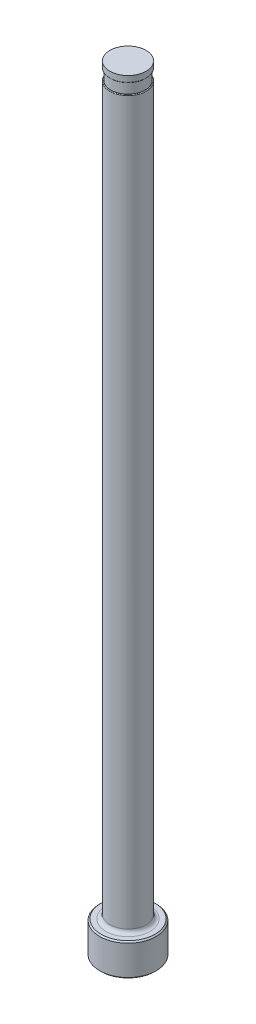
ISO-10303-21;
HEADER;
FILE_DESCRIPTION(('STEP AP214'),'2;1');
FILE_NAME('part.step','',(''),(''),'','','');
FILE_SCHEMA(('AUTOMOTIVE_DESIGN { 1 0 10303 214 1 1 1 1 }'));
ENDSEC;
DATA;
#1=APPLICATION_CONTEXT('core data for automotive mechanical design processes');
#2=APPLICATION_PROTOCOL_DEFINITION('international standard','automotive_design',2000,#1);
#3=PRODUCT_CONTEXT('',#1,'mechanical');
#4=PRODUCT('Part','Part','',(#3));
#5=PRODUCT_RELATED_PRODUCT_CATEGORY('part','',(#4));
#6=PRODUCT_DEFINITION_FORMATION('','',#4);
#7=PRODUCT_DEFINITION_CONTEXT('part definition',#1,'design');
#8=PRODUCT_DEFINITION('design','',#6,#7);
#9=PRODUCT_DEFINITION_SHAPE('','',#8);
#10=(LENGTH_UNIT() NAMED_UNIT(*) SI_UNIT(.MILLI.,.METRE.));
#11=(NAMED_UNIT(*) PLANE_ANGLE_UNIT() SI_UNIT($,.RADIAN.));
#12=(NAMED_UNIT(*) SI_UNIT($,.STERADIAN.) SOLID_ANGLE_UNIT());
#13=UNCERTAINTY_MEASURE_WITH_UNIT(LENGTH_MEASURE(1.E-05),#10,'distance_accuracy_value','');
#14=(GEOMETRIC_REPRESENTATION_CONTEXT(3) GLOBAL_UNCERTAINTY_ASSIGNED_CONTEXT((#13)) GLOBAL_UNIT_ASSIGNED_CONTEXT((#10,
#11,#12)) REPRESENTATION_CONTEXT('',''));
#15=CARTESIAN_POINT('',(0.,0.,0.));
#16=DIRECTION('',(0.,0.,1.));
#17=DIRECTION('',(1.,0.,0.));
#18=AXIS2_PLACEMENT_3D('',#15,#16,#17);
#19=CARTESIAN_POINT('',(-3.57123999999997,151.13,0.));
#20=DIRECTION('',(0.,1.,0.));
#21=DIRECTION('',(0.,0.,1.));
#22=AXIS2_PLACEMENT_3D('',#19,#20,#21);
#23=PLANE('',#22);
#24=CARTESIAN_POINT('',(0.,151.13,0.));
#25=DIRECTION('',(0.,1.,0.));
#26=DIRECTION('',(0.,0.,1.));
#27=AXIS2_PLACEMENT_3D('',#24,#25,#26);
#28=CIRCLE('',#27,3.43153999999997);
#29=CARTESIAN_POINT('',(0.,151.13,3.43153999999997));
#30=VERTEX_POINT('',#29);
#31=EDGE_CURVE('E11',#30,#30,#28,.F.);
#32=ORIENTED_EDGE('',*,*,#31,.T.);
#33=EDGE_LOOP('',(#32));
#34=FACE_BOUND('',#33,.T.);
#35=CARTESIAN_POINT('',(0.,151.13,0.));
#36=DIRECTION('',(0.,1.,0.));
#37=DIRECTION('',(0.,0.,1.));
#38=AXIS2_PLACEMENT_3D('',#35,#36,#37);
#39=CIRCLE('',#38,3.36803999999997);
#40=CARTESIAN_POINT('',(0.,151.13,3.36803999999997));
#41=VERTEX_POINT('',#40);
#42=EDGE_CURVE('E78',#41,#41,#39,.T.);
#43=ORIENTED_EDGE('',*,*,#42,.T.);
#44=EDGE_LOOP('',(#43));
#45=FACE_BOUND('',#44,.T.);
#46=ADVANCED_FACE('F36',(#34,#45),#23,.F.);
#47=CARTESIAN_POINT('',(0.,259.958771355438,0.));
#48=DIRECTION('',(0.,1.,0.));
#49=DIRECTION('',(0.,0.,1.));
#50=AXIS2_PLACEMENT_3D('',#47,#48,#49);
#51=CYLINDRICAL_SURFACE('',#50,3.57123999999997);
#52=DIRECTION('',(0.,1.,0.));
#53=VECTOR('',#52,1.);
#54=CARTESIAN_POINT('',(-3.36803999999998,259.958771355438,-1.18746018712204));
#55=LINE('',#54,#53);
#56=CARTESIAN_POINT('',(-3.36803999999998,148.971,-1.18746018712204));
#57=VERTEX_POINT('',#56);
#58=CARTESIAN_POINT('',(-3.36803999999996,86.614,-1.1874601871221));
#59=VERTEX_POINT('',#58);
#60=EDGE_CURVE('E73',#57,#59,#55,.F.);
#61=ORIENTED_EDGE('',*,*,#60,.F.);
#62=CARTESIAN_POINT('',(0.,148.971,0.));
#63=DIRECTION('',(0.,-1.,0.));
#64=DIRECTION('',(0.,0.,-1.));
#65=AXIS2_PLACEMENT_3D('',#62,#63,#64);
#66=CIRCLE('',#65,3.57123999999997);
#67=CARTESIAN_POINT('',(-3.36803999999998,148.971,1.18746018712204));
#68=VERTEX_POINT('',#67);
#69=EDGE_CURVE('E51',#57,#68,#66,.T.);
#70=ORIENTED_EDGE('',*,*,#69,.T.);
#71=DIRECTION('',(0.,1.,0.));
#72=VECTOR('',#71,1.);
#73=CARTESIAN_POINT('',(-3.36803999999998,259.958771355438,1.18746018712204));
#74=LINE('',#73,#72);
#75=CARTESIAN_POINT('',(-3.36803999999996,86.614,1.18746018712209));
#76=VERTEX_POINT('',#75);
#77=EDGE_CURVE('E84',#76,#68,#74,.T.);
#78=ORIENTED_EDGE('',*,*,#77,.F.);
#79=CARTESIAN_POINT('',(-3.36803999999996,86.614,-1.1874601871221));
#80=CARTESIAN_POINT('',(-3.3680377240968,86.5836283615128,-1.18745959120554));
#81=CARTESIAN_POINT('',(-3.36847634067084,86.55327189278,-1.18622334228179));
#82=CARTESIAN_POINT('',(-3.37021067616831,86.4927876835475,-1.18128966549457));
#83=CARTESIAN_POINT('',(-3.37150629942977,86.4626599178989,-1.1775925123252));
#84=CARTESIAN_POINT('',(-3.37663245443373,86.3730705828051,-1.16285138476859));
#85=CARTESIAN_POINT('',(-3.38170254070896,86.3142347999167,-1.14815759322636));
#86=CARTESIAN_POINT('',(-3.39461112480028,86.2000784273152,-1.10940606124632));
#87=CARTESIAN_POINT('',(-3.40245035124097,86.1447587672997,-1.08534585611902));
#88=CARTESIAN_POINT('',(-3.42005737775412,86.0391328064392,-1.02851526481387));
#89=CARTESIAN_POINT('',(-3.42982508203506,85.9888262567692,-0.995745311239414));
#90=CARTESIAN_POINT('',(-3.45028756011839,85.8943803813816,-0.922345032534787));
#91=CARTESIAN_POINT('',(-3.4609842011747,85.8502539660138,-0.881698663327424));
#92=CARTESIAN_POINT('',(-3.482209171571,85.7691926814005,-0.793737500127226));
#93=CARTESIAN_POINT('',(-3.49273745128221,85.7322598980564,-0.746420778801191));
#94=CARTESIAN_POINT('',(-3.51307583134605,85.6646585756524,-0.644120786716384));
#95=CARTESIAN_POINT('',(-3.52283072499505,85.6343557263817,-0.588885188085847));
#96=CARTESIAN_POINT('',(-3.54010786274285,85.5826078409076,-0.474091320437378));
#97=CARTESIAN_POINT('',(-3.54762954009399,85.5611650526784,-0.414531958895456));
#98=CARTESIAN_POINT('',(-3.56012114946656,85.5262555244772,-0.288969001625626));
#99=CARTESIAN_POINT('',(-3.56491124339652,85.5133434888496,-0.222793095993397));
#100=CARTESIAN_POINT('',(-3.57075657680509,85.497655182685,-0.0890807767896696));
#101=CARTESIAN_POINT('',(-3.57181063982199,85.494882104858,-0.0215439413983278));
#102=CARTESIAN_POINT('',(-3.57004535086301,85.4995778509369,0.115996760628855));
#103=CARTESIAN_POINT('',(-3.56706025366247,85.507484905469,0.185984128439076));
#104=CARTESIAN_POINT('',(-3.55722219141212,85.5343152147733,0.323545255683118));
#105=CARTESIAN_POINT('',(-3.55036911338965,85.5532387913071,0.391118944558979));
#106=CARTESIAN_POINT('',(-3.53356592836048,85.6018994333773,0.521506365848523));
#107=CARTESIAN_POINT('',(-3.52363012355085,85.6315866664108,0.584340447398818));
#108=CARTESIAN_POINT('',(-3.50178692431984,85.701455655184,0.703501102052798));
#109=CARTESIAN_POINT('',(-3.4898802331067,85.7416336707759,0.759829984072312));
#110=CARTESIAN_POINT('',(-3.46618365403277,85.8294388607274,0.861343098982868));
#111=CARTESIAN_POINT('',(-3.45441819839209,85.8765877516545,0.906946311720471));
#112=CARTESIAN_POINT('',(-3.4318469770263,85.9785334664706,0.988936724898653));
#113=CARTESIAN_POINT('',(-3.42104103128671,86.0333288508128,1.02532565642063));
#114=CARTESIAN_POINT('',(-3.40231953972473,86.1454535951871,1.08578170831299));
#115=CARTESIAN_POINT('',(-3.3942694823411,86.2024337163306,1.11045708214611));
#116=CARTESIAN_POINT('',(-3.38112795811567,86.3200270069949,1.14985485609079));
#117=CARTESIAN_POINT('',(-3.37603276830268,86.3806354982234,1.16458978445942));
#118=CARTESIAN_POINT('',(-3.37115526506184,86.4705050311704,1.17859463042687));
#119=CARTESIAN_POINT('',(-3.36998926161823,86.4991157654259,1.18192009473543));
#120=CARTESIAN_POINT('',(-3.36843159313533,86.556479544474,1.18635035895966));
#121=CARTESIAN_POINT('',(-3.36803858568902,86.5852322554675,1.18745900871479));
#122=CARTESIAN_POINT('',(-3.36803999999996,86.614,1.1874601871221));
#123=B_SPLINE_CURVE_WITH_KNOTS('',3,(#79,#80,#81,#82,#83,#84,#85,#86,#87,#88,#89,#90,#91,#92,
#93,#94,#95,#96,#97,#98,#99,#100,#101,#102,#103,#104,#105,#106,#107,#108,#109,#110,#111,#112,
#113,#114,#115,#116,#117,#118,#119,#120,#121,#122),.UNSPECIFIED.,.F.,.F.,(4,2,2,2,2,2,2,2,2,2,2,
2,2,2,2,2,2,2,2,2,2,4),(0.,0.0910565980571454,0.182103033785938,0.363698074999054,
0.545340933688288,0.726974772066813,0.908982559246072,1.09104304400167,1.28146671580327,
1.47193867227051,1.67381993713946,1.87576476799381,2.08625256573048,2.29674651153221,
2.50627812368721,2.71573513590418,2.91462117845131,3.1134698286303,3.30038893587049,
3.48707202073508,3.57347157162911,3.65972094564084),.UNSPECIFIED.);
#124=EDGE_CURVE('E81',#59,#76,#123,.T.);
#125=ORIENTED_EDGE('',*,*,#124,.F.);
#126=EDGE_LOOP('',(#61,#70,#78,#125));
#127=FACE_BOUND('',#126,.T.);
#128=CARTESIAN_POINT('',(0.,7.11200000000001,0.));
#129=DIRECTION('',(0.,1.,0.));
#130=DIRECTION('',(0.,0.,1.));
#131=AXIS2_PLACEMENT_3D('',#128,#129,#130);
#132=CIRCLE('',#131,3.57123999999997);
#133=CARTESIAN_POINT('',(0.,7.11200000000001,3.57123999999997));
#134=VERTEX_POINT('',#133);
#135=EDGE_CURVE('E116',#134,#134,#132,.T.);
#136=ORIENTED_EDGE('',*,*,#135,.T.);
#137=EDGE_LOOP('',(#136));
#138=FACE_BOUND('',#137,.T.);
#139=ADVANCED_FACE('F82',(#127,#138),#51,.T.);
#140=CARTESIAN_POINT('',(0.,0.,0.));
#141=DIRECTION('',(0.,-1.,0.));
#142=DIRECTION('',(0.,0.,-1.));
#143=AXIS2_PLACEMENT_3D('',#140,#141,#142);
#144=PLANE('',#143);
#145=CARTESIAN_POINT('',(0.,0.,0.));
#146=DIRECTION('',(0.,-1.,0.));
#147=DIRECTION('',(0.,0.,-1.));
#148=AXIS2_PLACEMENT_3D('',#145,#146,#147);
#149=CIRCLE('',#148,5.29589999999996);
#150=CARTESIAN_POINT('',(0.,0.,-5.29589999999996));
#151=VERTEX_POINT('',#150);
#152=EDGE_CURVE('E113',#151,#151,#149,.T.);
#153=ORIENTED_EDGE('',*,*,#152,.T.);
#154=EDGE_LOOP('',(#153));
#155=FACE_BOUND('',#154,.T.);
#156=ADVANCED_FACE('F192',(#155),#144,.T.);
#157=CARTESIAN_POINT('',(0.,259.958771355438,0.));
#158=DIRECTION('',(0.,1.,0.));
#159=DIRECTION('',(0.,0.,1.));
#160=AXIS2_PLACEMENT_3D('',#157,#158,#159);
#161=CYLINDRICAL_SURFACE('',#160,5.54989999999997);
#162=CARTESIAN_POINT('',(0.,6.09599999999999,0.));
#163=DIRECTION('',(0.,1.,0.));
#164=DIRECTION('',(0.,0.,1.));
#165=AXIS2_PLACEMENT_3D('',#162,#163,#164);
#166=CIRCLE('',#165,5.54989999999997);
#167=CARTESIAN_POINT('',(0.,6.09599999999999,5.54989999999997));
#168=VERTEX_POINT('',#167);
#169=EDGE_CURVE('E110',#168,#168,#166,.F.);
#170=ORIENTED_EDGE('',*,*,#169,.T.);
#171=EDGE_LOOP('',(#170));
#172=FACE_BOUND('',#171,.T.);
#173=CARTESIAN_POINT('',(0.,0.253999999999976,0.));
#174=DIRECTION('',(0.,-1.,0.));
#175=DIRECTION('',(0.,0.,-1.));
#176=AXIS2_PLACEMENT_3D('',#173,#174,#175);
#177=CIRCLE('',#176,5.54989999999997);
#178=CARTESIAN_POINT('',(0.,0.253999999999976,-5.54989999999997));
#179=VERTEX_POINT('',#178);
#180=EDGE_CURVE('E107',#179,#179,#177,.F.);
#181=ORIENTED_EDGE('',*,*,#180,.T.);
#182=EDGE_LOOP('',(#181));
#183=FACE_BOUND('',#182,.T.);
#184=ADVANCED_FACE('F195',(#172,#183),#161,.T.);
#185=CARTESIAN_POINT('',(-5.54989999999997,6.35,0.));
#186=DIRECTION('',(0.,1.,0.));
#187=DIRECTION('',(0.,0.,1.));
#188=AXIS2_PLACEMENT_3D('',#185,#186,#187);
#189=PLANE('',#188);
#190=CARTESIAN_POINT('',(0.,6.35,0.));
#191=DIRECTION('',(0.,1.,0.));
#192=DIRECTION('',(0.,0.,1.));
#193=AXIS2_PLACEMENT_3D('',#190,#191,#192);
#194=CIRCLE('',#193,4.33323999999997);
#195=CARTESIAN_POINT('',(0.,6.35,4.33323999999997));
#196=VERTEX_POINT('',#195);
#197=EDGE_CURVE('E87',#196,#196,#194,.F.);
#198=ORIENTED_EDGE('',*,*,#197,.T.);
#199=EDGE_LOOP('',(#198));
#200=FACE_BOUND('',#199,.T.);
#201=CARTESIAN_POINT('',(0.,6.35,0.));
#202=DIRECTION('',(0.,1.,0.));
#203=DIRECTION('',(0.,0.,1.));
#204=AXIS2_PLACEMENT_3D('',#201,#202,#203);
#205=CIRCLE('',#204,5.29589999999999);
#206=CARTESIAN_POINT('',(0.,6.35,5.29589999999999));
#207=VERTEX_POINT('',#206);
#208=EDGE_CURVE('E104',#207,#207,#205,.T.);
#209=ORIENTED_EDGE('',*,*,#208,.T.);
#210=EDGE_LOOP('',(#209));
#211=FACE_BOUND('',#210,.T.);
#212=ADVANCED_FACE('F190',(#200,#211),#189,.T.);
#213=CARTESIAN_POINT('',(0.,6.35000000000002,0.));
#214=DIRECTION('',(0.,-1.,0.));
#215=DIRECTION('',(0.,0.,-1.));
#216=AXIS2_PLACEMENT_3D('',#213,#214,#215);
#217=CONICAL_SURFACE('',#216,5.29589999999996,0.785398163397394);
#218=ORIENTED_EDGE('',*,*,#169,.F.);
#219=EDGE_LOOP('',(#218));
#220=FACE_BOUND('',#219,.T.);
#221=ORIENTED_EDGE('',*,*,#208,.F.);
#222=EDGE_LOOP('',(#221));
#223=FACE_BOUND('',#222,.T.);
#224=ADVANCED_FACE('F186',(#220,#223),#217,.T.);
#225=CARTESIAN_POINT('',(0.,0.253999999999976,0.));
#226=DIRECTION('',(0.,1.,0.));
#227=DIRECTION('',(0.,0.,1.));
#228=AXIS2_PLACEMENT_3D('',#225,#226,#227);
#229=CONICAL_SURFACE('',#228,5.54989999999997,0.785398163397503);
#230=ORIENTED_EDGE('',*,*,#152,.F.);
#231=EDGE_LOOP('',(#230));
#232=FACE_BOUND('',#231,.T.);
#233=ORIENTED_EDGE('',*,*,#180,.F.);
#234=EDGE_LOOP('',(#233));
#235=FACE_BOUND('',#234,.T.);
#236=ADVANCED_FACE('F182',(#232,#235),#229,.T.);
#237=CARTESIAN_POINT('',(0.,7.11200000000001,0.));
#238=DIRECTION('',(0.,1.,0.));
#239=DIRECTION('',(0.,0.,1.));
#240=AXIS2_PLACEMENT_3D('',#237,#238,#239);
#241=TOROIDAL_SURFACE('',#240,4.33323999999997,0.762);
#242=ORIENTED_EDGE('',*,*,#197,.F.);
#243=EDGE_LOOP('',(#242));
#244=FACE_BOUND('',#243,.T.);
#245=ORIENTED_EDGE('',*,*,#135,.F.);
#246=EDGE_LOOP('',(#245));
#247=FACE_BOUND('',#246,.T.);
#248=ADVANCED_FACE('F147',(#244,#247),#241,.F.);
#249=CARTESIAN_POINT('',(-3.57123999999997,149.098,0.));
#250=DIRECTION('',(0.,-1.,0.));
#251=DIRECTION('',(0.,0.,-1.));
#252=AXIS2_PLACEMENT_3D('',#249,#250,#251);
#253=PLANE('',#252);
#254=DIRECTION('',(0.,0.,1.));
#255=VECTOR('',#254,1.);
#256=CARTESIAN_POINT('',(-3.36803999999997,149.098,0.));
#257=LINE('',#256,#255);
#258=CARTESIAN_POINT('',(-3.36803999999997,149.098,0.));
#259=VERTEX_POINT('',#258);
#260=CARTESIAN_POINT('',(-3.36803999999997,149.098,0.720482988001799));
#261=VERTEX_POINT('',#260);
#262=EDGE_CURVE('E90',#259,#261,#257,.T.);
#263=ORIENTED_EDGE('',*,*,#262,.T.);
#264=CARTESIAN_POINT('',(0.,149.098,0.));
#265=DIRECTION('',(0.,-1.,0.));
#266=DIRECTION('',(0.,0.,-1.));
#267=AXIS2_PLACEMENT_3D('',#264,#265,#266);
#268=CIRCLE('',#267,3.44423999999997);
#269=CARTESIAN_POINT('',(-3.36803999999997,149.098,-0.720482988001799));
#270=VERTEX_POINT('',#269);
#271=EDGE_CURVE('E86',#261,#270,#268,.F.);
#272=ORIENTED_EDGE('',*,*,#271,.T.);
#273=EDGE_CURVE('E79',#270,#259,#257,.T.);
#274=ORIENTED_EDGE('',*,*,#273,.T.);
#275=CARTESIAN_POINT('',(0.,149.098,0.));
#276=DIRECTION('',(0.,1.,0.));
#277=DIRECTION('',(0.,0.,1.));
#278=AXIS2_PLACEMENT_3D('',#275,#276,#277);
#279=CIRCLE('',#278,3.36803999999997);
#280=EDGE_CURVE('E101',#259,#259,#279,.T.);
#281=ORIENTED_EDGE('',*,*,#280,.F.);
#282=EDGE_LOOP('',(#263,#272,#274,#281));
#283=FACE_BOUND('',#282,.T.);
#284=ADVANCED_FACE('F144',(#283),#253,.F.);
#285=CARTESIAN_POINT('',(0.,153.448281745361,0.));
#286=DIRECTION('',(0.,1.,0.));
#287=DIRECTION('',(0.,0.,1.));
#288=AXIS2_PLACEMENT_3D('',#285,#286,#287);
#289=CYLINDRICAL_SURFACE('',#288,3.36803999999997);
#290=ORIENTED_EDGE('',*,*,#42,.F.);
#291=EDGE_LOOP('',(#290));
#292=FACE_BOUND('',#291,.T.);
#293=ORIENTED_EDGE('',*,*,#280,.T.);
#294=EDGE_LOOP('',(#293));
#295=FACE_BOUND('',#294,.T.);
#296=ADVANCED_FACE('F141',(#292,#295),#289,.T.);
#297=CARTESIAN_POINT('',(-3.36803999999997,150.114,-5.54989999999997));
#298=DIRECTION('',(1.,0.,0.));
#299=DIRECTION('',(0.,1.,0.));
#300=AXIS2_PLACEMENT_3D('',#297,#298,#299);
#301=PLANE('',#300);
#302=ORIENTED_EDGE('',*,*,#273,.F.);
#303=CARTESIAN_POINT('',(-3.36803999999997,149.098,-0.720482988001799));
#304=CARTESIAN_POINT('',(-3.36803999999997,149.097993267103,-0.741667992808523));
#305=CARTESIAN_POINT('',(-3.36803999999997,149.097767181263,-0.76285784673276));
#306=CARTESIAN_POINT('',(-3.36803999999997,149.09671621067,-0.80525692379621));
#307=CARTESIAN_POINT('',(-3.36803999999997,149.095890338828,-0.826466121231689));
#308=CARTESIAN_POINT('',(-3.36803999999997,149.093476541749,-0.86888093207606));
#309=CARTESIAN_POINT('',(-3.36803999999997,149.091887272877,-0.890086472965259));
#310=CARTESIAN_POINT('',(-3.36803999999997,149.087714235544,-0.932390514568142));
#311=CARTESIAN_POINT('',(-3.36803999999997,149.085131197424,-0.953489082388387));
#312=CARTESIAN_POINT('',(-3.36803999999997,149.079919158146,-0.987044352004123));
#313=CARTESIAN_POINT('',(-3.36803999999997,149.077725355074,-0.999568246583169));
#314=CARTESIAN_POINT('',(-3.36803999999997,149.072729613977,-1.02450849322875));
#315=CARTESIAN_POINT('',(-3.36803999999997,149.06992716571,-1.03692474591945));
#316=CARTESIAN_POINT('',(-3.36803999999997,149.06343040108,-1.06198397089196));
#317=CARTESIAN_POINT('',(-3.36803999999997,149.059708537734,-1.07461988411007));
#318=CARTESIAN_POINT('',(-3.36803999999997,149.051125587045,-1.09949809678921));
#319=CARTESIAN_POINT('',(-3.36803999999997,149.046266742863,-1.11174111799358));
#320=CARTESIAN_POINT('',(-3.36803999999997,149.037811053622,-1.12921604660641));
#321=CARTESIAN_POINT('',(-3.36803999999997,149.03488164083,-1.13476833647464));
#322=CARTESIAN_POINT('',(-3.36803999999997,149.028508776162,-1.14558508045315));
#323=CARTESIAN_POINT('',(-3.36803999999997,149.025064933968,-1.15084931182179));
#324=CARTESIAN_POINT('',(-3.36803999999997,149.018291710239,-1.15984658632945));
#325=CARTESIAN_POINT('',(-3.36803999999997,149.015085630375,-1.16367129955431));
#326=CARTESIAN_POINT('',(-3.36803999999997,149.008150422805,-1.17081956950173));
#327=CARTESIAN_POINT('',(-3.36803999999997,149.004422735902,-1.17414445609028));
#328=CARTESIAN_POINT('',(-3.36803999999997,148.998066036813,-1.17872666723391));
#329=CARTESIAN_POINT('',(-3.36803999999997,148.995640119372,-1.18026334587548));
#330=CARTESIAN_POINT('',(-3.36803999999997,148.990593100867,-1.18295888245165));
#331=CARTESIAN_POINT('',(-3.36803999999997,148.987972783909,-1.18411916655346));
#332=CARTESIAN_POINT('',(-3.36803999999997,148.982986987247,-1.18581641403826));
#333=CARTESIAN_POINT('',(-3.36803999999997,148.980645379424,-1.18642231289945));
#334=CARTESIAN_POINT('',(-3.36803999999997,148.975871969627,-1.18724906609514));
#335=CARTESIAN_POINT('',(-3.36803999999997,148.973439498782,-1.18746599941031));
#336=CARTESIAN_POINT('',(-3.36803999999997,148.971,-1.18746018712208));
#337=B_SPLINE_CURVE_WITH_KNOTS('',3,(#303,#304,#305,#306,#307,#308,#309,#310,#311,#312,#313,
#314,#315,#316,#317,#318,#319,#320,#321,#322,#323,#324,#325,#326,#327,#328,#329,#330,#331,#332,
#333,#334,#335,#336),.UNSPECIFIED.,.F.,.F.,(4,2,2,2,2,2,2,2,2,2,2,2,2,2,2,2,4),(0.,
0.0635614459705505,0.127227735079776,0.191006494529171,0.254738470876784,0.292871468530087,
0.331036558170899,0.370524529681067,0.409935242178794,0.428750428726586,0.447579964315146,
0.462519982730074,0.477419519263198,0.486010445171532,0.494568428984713,0.501793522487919,
0.509091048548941),.UNSPECIFIED.);
#338=EDGE_CURVE('E59',#270,#57,#337,.T.);
#339=ORIENTED_EDGE('',*,*,#338,.T.);
#340=ORIENTED_EDGE('',*,*,#60,.T.);
#341=DIRECTION('',(0.,0.,1.));
#342=VECTOR('',#341,1.);
#343=CARTESIAN_POINT('',(-3.36803999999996,86.614,-5.54989999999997));
#344=LINE('',#343,#342);
#345=EDGE_CURVE('E77',#59,#76,#344,.T.);
#346=ORIENTED_EDGE('',*,*,#345,.T.);
#347=ORIENTED_EDGE('',*,*,#77,.T.);
#348=CARTESIAN_POINT('',(-3.36803999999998,148.971,1.18746018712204));
#349=CARTESIAN_POINT('',(-3.36803999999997,148.973718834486,1.18746847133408));
#350=CARTESIAN_POINT('',(-3.36803999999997,148.976426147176,1.18719803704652));
#351=CARTESIAN_POINT('',(-3.36803999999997,148.981714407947,1.18617805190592));
#352=CARTESIAN_POINT('',(-3.36803999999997,148.984296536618,1.18543473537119));
#353=CARTESIAN_POINT('',(-3.36803999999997,148.989910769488,1.183315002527));
#354=CARTESIAN_POINT('',(-3.36803999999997,148.992900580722,1.18182891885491));
#355=CARTESIAN_POINT('',(-3.36803999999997,148.998613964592,1.17839592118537));
#356=CARTESIAN_POINT('',(-3.36803999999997,149.00133604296,1.17644660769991));
#357=CARTESIAN_POINT('',(-3.36803999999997,149.00827895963,1.17078841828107));
#358=CARTESIAN_POINT('',(-3.36803999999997,149.012257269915,1.16678561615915));
#359=CARTESIAN_POINT('',(-3.36803999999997,149.019603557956,1.15826505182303));
#360=CARTESIAN_POINT('',(-3.36803999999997,149.02297020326,1.15374619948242));
#361=CARTESIAN_POINT('',(-3.36803999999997,149.034637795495,1.13637607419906));
#362=CARTESIAN_POINT('',(-3.36803999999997,149.04146833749,1.1225589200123));
#363=CARTESIAN_POINT('',(-3.36803999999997,149.053284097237,1.09405878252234));
#364=CARTESIAN_POINT('',(-3.36803999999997,149.058244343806,1.07936692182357));
#365=CARTESIAN_POINT('',(-3.36803999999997,149.06678105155,1.04990009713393));
#366=CARTESIAN_POINT('',(-3.36803999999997,149.070383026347,1.03513257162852));
#367=CARTESIAN_POINT('',(-3.36803999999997,149.076680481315,1.00540216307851));
#368=CARTESIAN_POINT('',(-3.36803999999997,149.079375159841,0.99043911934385));
#369=CARTESIAN_POINT('',(-3.36803999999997,149.086439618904,0.945273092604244));
#370=CARTESIAN_POINT('',(-3.36803999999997,149.089761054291,0.914907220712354));
#371=CARTESIAN_POINT('',(-3.36803999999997,149.094361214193,0.857080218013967));
#372=CARTESIAN_POINT('',(-3.36803999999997,149.0958100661,0.829630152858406));
#373=CARTESIAN_POINT('',(-3.36803999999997,149.097615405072,0.774944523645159));
#374=CARTESIAN_POINT('',(-3.36803999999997,149.097981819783,0.747709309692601));
#375=CARTESIAN_POINT('',(-3.36803999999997,149.098,0.720482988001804));
#376=B_SPLINE_CURVE_WITH_KNOTS('',3,(#348,#349,#350,#351,#352,#353,#354,#355,#356,#357,#358,
#359,#360,#361,#362,#363,#364,#365,#366,#367,#368,#369,#370,#371,#372,#373,#374,#375),
.UNSPECIFIED.,.F.,.F.,(4,2,2,2,2,2,2,2,2,2,2,2,2,4),(0.,0.00812455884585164,0.0161441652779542,
0.0261041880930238,0.0361169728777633,0.0529520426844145,0.069823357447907,0.115707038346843,
0.162183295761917,0.207737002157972,0.253330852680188,0.34486973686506,0.427316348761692,
0.509004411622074),.UNSPECIFIED.);
#377=EDGE_CURVE('E172',#68,#261,#376,.T.);
#378=ORIENTED_EDGE('',*,*,#377,.T.);
#379=ORIENTED_EDGE('',*,*,#262,.F.);
#380=EDGE_LOOP('',(#302,#339,#340,#346,#347,#378,#379));
#381=FACE_BOUND('',#380,.T.);
#382=ADVANCED_FACE('F75',(#381),#301,.F.);
#383=CARTESIAN_POINT('',(-6.54303999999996,86.614,-5.54989999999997));
#384=DIRECTION('',(0.,0.,1.));
#385=DIRECTION('',(1.,0.,0.));
#386=AXIS2_PLACEMENT_3D('',#383,#384,#385);
#387=CYLINDRICAL_SURFACE('',#386,3.175);
#388=ORIENTED_EDGE('',*,*,#345,.F.);
#389=ORIENTED_EDGE('',*,*,#124,.T.);
#390=EDGE_LOOP('',(#388,#389));
#391=FACE_BOUND('',#390,.T.);
#392=ADVANCED_FACE('F89',(#391),#387,.F.);
#393=CARTESIAN_POINT('',(0.,152.687735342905,0.));
#394=DIRECTION('',(0.,1.,0.));
#395=DIRECTION('',(0.,0.,1.));
#396=AXIS2_PLACEMENT_3D('',#393,#394,#395);
#397=CYLINDRICAL_SURFACE('',#396,3.55853999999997);
#398=CARTESIAN_POINT('',(0.,151.257,0.));
#399=DIRECTION('',(0.,1.,0.));
#400=DIRECTION('',(0.,0.,1.));
#401=AXIS2_PLACEMENT_3D('',#398,#399,#400);
#402=CIRCLE('',#401,3.55853999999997);
#403=CARTESIAN_POINT('',(0.,151.257,3.55853999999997));
#404=VERTEX_POINT('',#403);
#405=EDGE_CURVE('E44',#404,#404,#402,.T.);
#406=ORIENTED_EDGE('',*,*,#405,.T.);
#407=EDGE_LOOP('',(#406));
#408=FACE_BOUND('',#407,.T.);
#409=CARTESIAN_POINT('',(0.,152.4,0.));
#410=DIRECTION('',(0.,1.,0.));
#411=DIRECTION('',(0.,0.,1.));
#412=AXIS2_PLACEMENT_3D('',#409,#410,#411);
#413=CIRCLE('',#412,3.55853999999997);
#414=CARTESIAN_POINT('',(0.,152.4,3.55853999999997));
#415=VERTEX_POINT('',#414);
#416=EDGE_CURVE('E91',#415,#415,#413,.T.);
#417=ORIENTED_EDGE('',*,*,#416,.F.);
#418=EDGE_LOOP('',(#417));
#419=FACE_BOUND('',#418,.T.);
#420=ADVANCED_FACE('F135',(#408,#419),#397,.T.);
#421=CARTESIAN_POINT('',(-3.57123999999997,152.4,0.));
#422=DIRECTION('',(0.,1.,0.));
#423=DIRECTION('',(0.,0.,1.));
#424=AXIS2_PLACEMENT_3D('',#421,#422,#423);
#425=PLANE('',#424);
#426=ORIENTED_EDGE('',*,*,#416,.T.);
#427=EDGE_LOOP('',(#426));
#428=FACE_BOUND('',#427,.T.);
#429=ADVANCED_FACE('F149',(#428),#425,.T.);
#430=CARTESIAN_POINT('',(0.,148.971,0.));
#431=DIRECTION('',(0.,-1.,0.));
#432=DIRECTION('',(0.,0.,-1.));
#433=AXIS2_PLACEMENT_3D('',#430,#431,#432);
#434=TOROIDAL_SURFACE('',#433,3.44423999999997,0.127);
#435=ORIENTED_EDGE('',*,*,#377,.F.);
#436=ORIENTED_EDGE('',*,*,#69,.F.);
#437=ORIENTED_EDGE('',*,*,#338,.F.);
#438=ORIENTED_EDGE('',*,*,#271,.F.);
#439=EDGE_LOOP('',(#435,#436,#437,#438));
#440=FACE_BOUND('',#439,.T.);
#441=ADVANCED_FACE('F151',(#440),#434,.T.);
#442=CARTESIAN_POINT('',(0.,151.257,0.));
#443=DIRECTION('',(0.,1.,0.));
#444=DIRECTION('',(0.,0.,1.));
#445=AXIS2_PLACEMENT_3D('',#442,#443,#444);
#446=TOROIDAL_SURFACE('',#445,3.43153999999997,0.127);
#447=ORIENTED_EDGE('',*,*,#31,.F.);
#448=EDGE_LOOP('',(#447));
#449=FACE_BOUND('',#448,.T.);
#450=ORIENTED_EDGE('',*,*,#405,.F.);
#451=EDGE_LOOP('',(#450));
#452=FACE_BOUND('',#451,.T.);
#453=ADVANCED_FACE('F38',(#449,#452),#446,.T.);
#454=CLOSED_SHELL('',(#46,#139,#156,#184,#212,#224,#236,#248,#284,#296,#382,#392,#420,#429,#441,#453));
#455=MANIFOLD_SOLID_BREP('B2',#454);
#456=ADVANCED_BREP_SHAPE_REPRESENTATION('',(#18,#455),#14);
#457=SHAPE_DEFINITION_REPRESENTATION(#9,#456);
ENDSEC;
END-ISO-10303-21;
